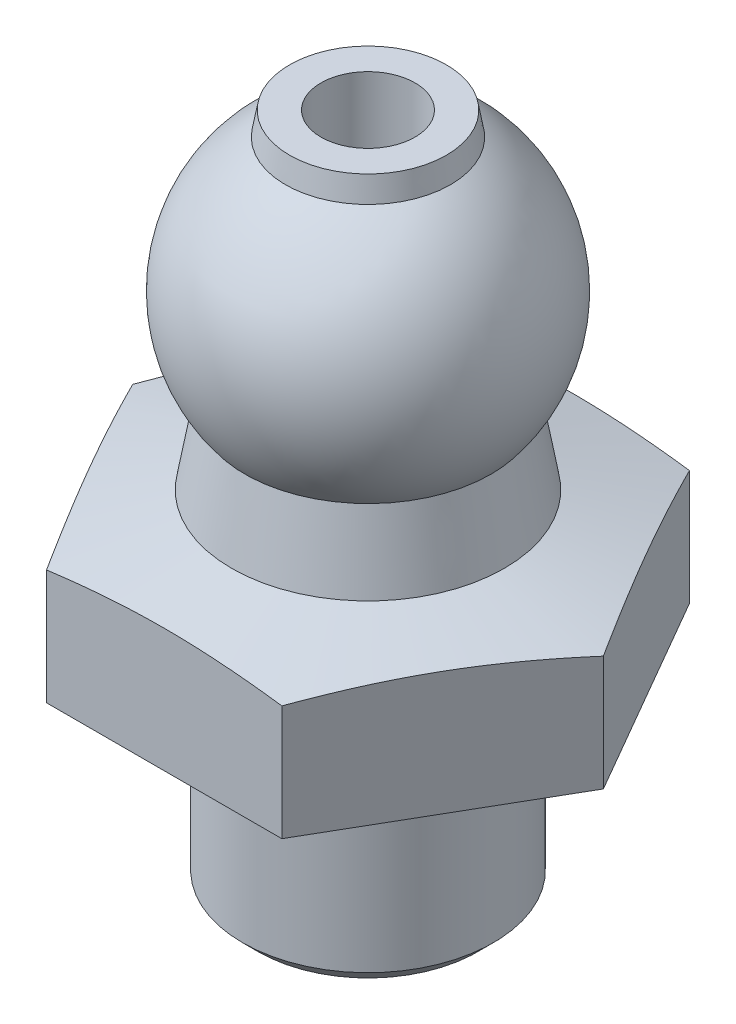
from build123d import *

# Parameters (mm, degrees)
ESQUISSE2_OUTSIDE_W     = 29.106
ESQUISSE2_OUTSIDE_H     = 29.106
ENL_V_MAT_EXTRU_1_DEPTH = 21.615528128


with BuildPart() as part:
    # Esquisse1 → Base-R_volution (revolve)
    with BuildSketch(Plane.XY, mode=Mode.PRIVATE) as base_r_volution_sk:
        with BuildLine():
            Line((1.5, 15), (1.5, -6.5))
            Line((1.5, -6.5), (3.5, -6.5))
            Line((3.5, -6.5), (4, -6))
            Line((4, -6), (4, 0))
            Line((4, 0), (10, 0))
            Line((10, 0), (10, 3))
            Line((10, 3), (4.348929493, 4.514199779))
            Line((4.348929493, 4.514199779), (3.927291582, 6.905427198))
            ThreePointArc((3.927291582, 6.905427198), (4.924038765, 10.868240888), (2.632040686, 14.251160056))
            Line((2.632040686, 14.251160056), (2.5, 15))
            Line((2.5, 15), (1.5, 15))
        make_face()
    revolve(base_r_volution_sk.sketch.rotate(Axis((0, 24.87628866, 0), (0, -1, 0)), 90), axis=Axis((0, 24.87628866, 0), (0, -1, 0)))

    # Esquisse2 outside → Enl_v. mat.-Extru.1 (cut, through all)
    with BuildSketch(Plane.XZ):
        Rectangle(ESQUISSE2_OUTSIDE_W, ESQUISSE2_OUTSIDE_H)
        Polygon((-3.75277675, 6.5), (3.75277675, 6.5), (7.505553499, 0), (3.75277675, -6.5), (-3.75277675, -6.5), (-7.505553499, 0), align=None, mode=Mode.SUBTRACT)
    extrude(amount=-ENL_V_MAT_EXTRU_1_DEPTH, mode=Mode.SUBTRACT)


solid = part.part
